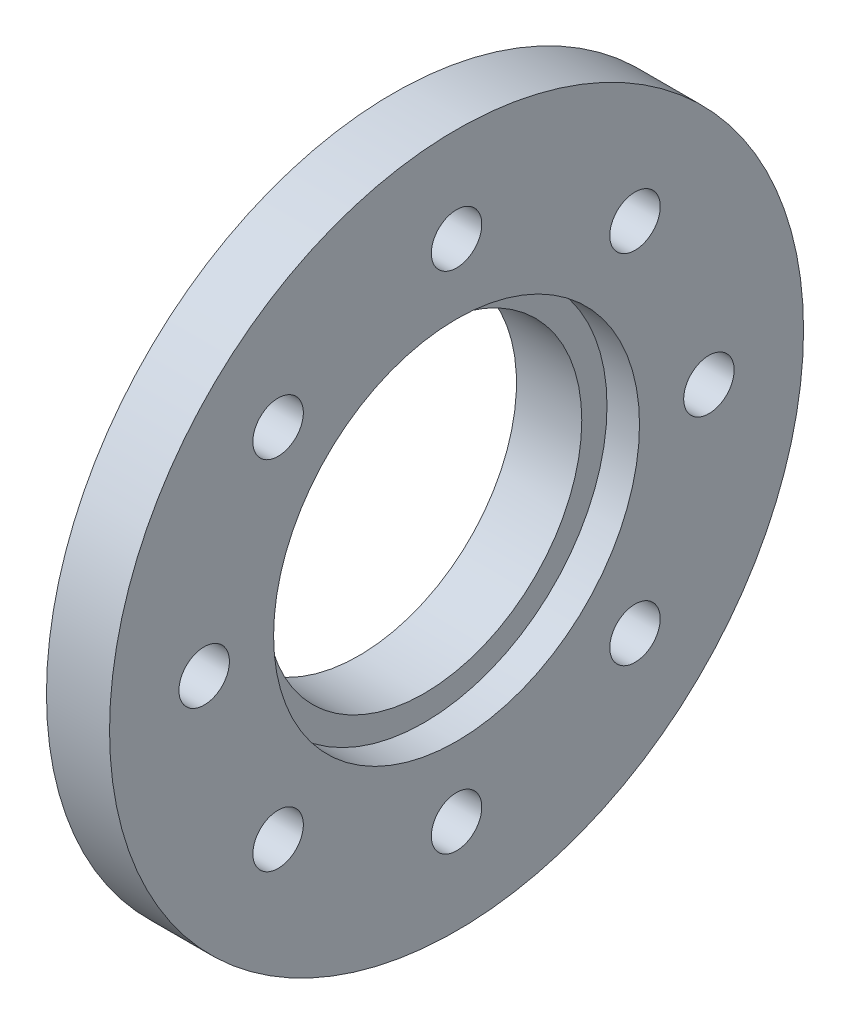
ISO-10303-21;
HEADER;
FILE_DESCRIPTION(('STEP AP214'),'2;1');
FILE_NAME('part.step','',(''),(''),'','','');
FILE_SCHEMA(('AUTOMOTIVE_DESIGN { 1 0 10303 214 1 1 1 1 }'));
ENDSEC;
DATA;
#1=APPLICATION_CONTEXT('core data for automotive mechanical design processes');
#2=APPLICATION_PROTOCOL_DEFINITION('international standard','automotive_design',2000,#1);
#3=PRODUCT_CONTEXT('',#1,'mechanical');
#4=PRODUCT('Part','Part','',(#3));
#5=PRODUCT_RELATED_PRODUCT_CATEGORY('part','',(#4));
#6=PRODUCT_DEFINITION_FORMATION('','',#4);
#7=PRODUCT_DEFINITION_CONTEXT('part definition',#1,'design');
#8=PRODUCT_DEFINITION('design','',#6,#7);
#9=PRODUCT_DEFINITION_SHAPE('','',#8);
#10=(LENGTH_UNIT() NAMED_UNIT(*) SI_UNIT(.MILLI.,.METRE.));
#11=(NAMED_UNIT(*) PLANE_ANGLE_UNIT() SI_UNIT($,.RADIAN.));
#12=(NAMED_UNIT(*) SI_UNIT($,.STERADIAN.) SOLID_ANGLE_UNIT());
#13=UNCERTAINTY_MEASURE_WITH_UNIT(LENGTH_MEASURE(1.E-05),#10,'distance_accuracy_value','');
#14=(GEOMETRIC_REPRESENTATION_CONTEXT(3) GLOBAL_UNCERTAINTY_ASSIGNED_CONTEXT((#13)) GLOBAL_UNIT_ASSIGNED_CONTEXT((#10,
#11,#12)) REPRESENTATION_CONTEXT('',''));
#15=CARTESIAN_POINT('',(0.,0.,0.));
#16=DIRECTION('',(0.,0.,1.));
#17=DIRECTION('',(1.,0.,0.));
#18=AXIS2_PLACEMENT_3D('',#15,#16,#17);
#19=CARTESIAN_POINT('',(0.,0.,0.));
#20=DIRECTION('',(-1.,0.,0.));
#21=DIRECTION('',(0.,0.,1.));
#22=AXIS2_PLACEMENT_3D('',#19,#20,#21);
#23=CYLINDRICAL_SURFACE('',#22,5.);
#24=CARTESIAN_POINT('',(0.,0.,0.));
#25=DIRECTION('',(-1.,0.,0.));
#26=DIRECTION('',(0.,0.,1.));
#27=AXIS2_PLACEMENT_3D('',#24,#25,#26);
#28=CIRCLE('',#27,5.);
#29=CARTESIAN_POINT('',(0.,0.,5.));
#30=VERTEX_POINT('',#29);
#31=EDGE_CURVE('E100',#30,#30,#28,.F.);
#32=ORIENTED_EDGE('',*,*,#31,.F.);
#33=EDGE_LOOP('',(#32));
#34=FACE_BOUND('',#33,.T.);
#35=CARTESIAN_POINT('',(2.07,0.,0.));
#36=DIRECTION('',(1.,0.,0.));
#37=DIRECTION('',(0.,0.,-1.));
#38=AXIS2_PLACEMENT_3D('',#35,#36,#37);
#39=CIRCLE('',#38,5.);
#40=CARTESIAN_POINT('',(2.07,0.,-5.));
#41=VERTEX_POINT('',#40);
#42=EDGE_CURVE('E108',#41,#41,#39,.T.);
#43=ORIENTED_EDGE('',*,*,#42,.T.);
#44=EDGE_LOOP('',(#43));
#45=FACE_BOUND('',#44,.T.);
#46=ADVANCED_FACE('F29',(#34,#45),#23,.F.);
#47=CARTESIAN_POINT('',(0.,5.,0.));
#48=DIRECTION('',(1.,0.,0.));
#49=DIRECTION('',(0.,0.,-1.));
#50=AXIS2_PLACEMENT_3D('',#47,#48,#49);
#51=PLANE('',#50);
#52=CARTESIAN_POINT('',(0.,0.,0.));
#53=DIRECTION('',(-1.,0.,0.));
#54=DIRECTION('',(0.,0.,1.));
#55=AXIS2_PLACEMENT_3D('',#52,#53,#54);
#56=CIRCLE('',#55,6.25);
#57=CARTESIAN_POINT('',(0.,0.,6.25000000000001));
#58=VERTEX_POINT('',#57);
#59=EDGE_CURVE('E33',#58,#58,#56,.F.);
#60=ORIENTED_EDGE('',*,*,#59,.F.);
#61=EDGE_LOOP('',(#60));
#62=FACE_BOUND('',#61,.T.);
#63=ORIENTED_EDGE('',*,*,#31,.T.);
#64=EDGE_LOOP('',(#63));
#65=FACE_BOUND('',#64,.T.);
#66=ADVANCED_FACE('F118',(#62,#65),#51,.F.);
#67=CARTESIAN_POINT('',(0.,0.,0.));
#68=DIRECTION('',(-1.,0.,0.));
#69=DIRECTION('',(0.,0.,1.));
#70=AXIS2_PLACEMENT_3D('',#67,#68,#69);
#71=CYLINDRICAL_SURFACE('',#70,6.25);
#72=ORIENTED_EDGE('',*,*,#59,.T.);
#73=EDGE_LOOP('',(#72));
#74=FACE_BOUND('',#73,.T.);
#75=CARTESIAN_POINT('',(1.1,0.,0.));
#76=DIRECTION('',(-1.,0.,0.));
#77=DIRECTION('',(0.,0.,1.));
#78=AXIS2_PLACEMENT_3D('',#75,#76,#77);
#79=CIRCLE('',#78,6.25);
#80=CARTESIAN_POINT('',(1.1,0.,6.25000000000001));
#81=VERTEX_POINT('',#80);
#82=EDGE_CURVE('E98',#81,#81,#79,.T.);
#83=ORIENTED_EDGE('',*,*,#82,.T.);
#84=EDGE_LOOP('',(#83));
#85=FACE_BOUND('',#84,.T.);
#86=ADVANCED_FACE('F126',(#74,#85),#71,.T.);
#87=CARTESIAN_POINT('',(1.1,6.25,0.));
#88=DIRECTION('',(1.,0.,0.));
#89=DIRECTION('',(0.,0.,-1.));
#90=AXIS2_PLACEMENT_3D('',#87,#88,#89);
#91=PLANE('',#90);
#92=CARTESIAN_POINT('',(1.1,5.65685424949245,-5.65685424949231));
#93=DIRECTION('',(-1.,0.,0.));
#94=DIRECTION('',(0.,0.,1.));
#95=AXIS2_PLACEMENT_3D('',#92,#93,#94);
#96=CIRCLE('',#95,0.799999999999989);
#97=CARTESIAN_POINT('',(1.1,5.65685424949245,-4.85685424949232));
#98=VERTEX_POINT('',#97);
#99=EDGE_CURVE('E95',#98,#98,#96,.F.);
#100=ORIENTED_EDGE('',*,*,#99,.T.);
#101=EDGE_LOOP('',(#100));
#102=FACE_BOUND('',#101,.T.);
#103=CARTESIAN_POINT('',(1.1,0.,-8.00000000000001));
#104=DIRECTION('',(-1.,0.,0.));
#105=DIRECTION('',(0.,0.,1.));
#106=AXIS2_PLACEMENT_3D('',#103,#104,#105);
#107=CIRCLE('',#106,0.799999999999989);
#108=CARTESIAN_POINT('',(1.1,0.,-7.20000000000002));
#109=VERTEX_POINT('',#108);
#110=EDGE_CURVE('E92',#109,#109,#107,.F.);
#111=ORIENTED_EDGE('',*,*,#110,.T.);
#112=EDGE_LOOP('',(#111));
#113=FACE_BOUND('',#112,.T.);
#114=CARTESIAN_POINT('',(1.1,0.,0.));
#115=DIRECTION('',(-1.,0.,0.));
#116=DIRECTION('',(0.,0.,1.));
#117=AXIS2_PLACEMENT_3D('',#114,#115,#116);
#118=CIRCLE('',#117,11.);
#119=CARTESIAN_POINT('',(1.1,0.,11.));
#120=VERTEX_POINT('',#119);
#121=EDGE_CURVE('E71',#120,#120,#118,.F.);
#122=ORIENTED_EDGE('',*,*,#121,.F.);
#123=EDGE_LOOP('',(#122));
#124=FACE_BOUND('',#123,.T.);
#125=ORIENTED_EDGE('',*,*,#82,.F.);
#126=EDGE_LOOP('',(#125));
#127=FACE_BOUND('',#126,.T.);
#128=CARTESIAN_POINT('',(1.1,8.,0.));
#129=DIRECTION('',(-1.,0.,0.));
#130=DIRECTION('',(0.,0.,1.));
#131=AXIS2_PLACEMENT_3D('',#128,#129,#130);
#132=CIRCLE('',#131,0.799999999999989);
#133=CARTESIAN_POINT('',(1.1,8.,0.799999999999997));
#134=VERTEX_POINT('',#133);
#135=EDGE_CURVE('E74',#134,#134,#132,.F.);
#136=ORIENTED_EDGE('',*,*,#135,.T.);
#137=EDGE_LOOP('',(#136));
#138=FACE_BOUND('',#137,.T.);
#139=CARTESIAN_POINT('',(1.1,5.65685424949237,5.6568542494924));
#140=DIRECTION('',(-1.,0.,0.));
#141=DIRECTION('',(0.,0.,1.));
#142=AXIS2_PLACEMENT_3D('',#139,#140,#141);
#143=CIRCLE('',#142,0.799999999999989);
#144=CARTESIAN_POINT('',(1.1,5.65685424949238,6.45685424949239));
#145=VERTEX_POINT('',#144);
#146=EDGE_CURVE('E77',#145,#145,#143,.F.);
#147=ORIENTED_EDGE('',*,*,#146,.T.);
#148=EDGE_LOOP('',(#147));
#149=FACE_BOUND('',#148,.T.);
#150=CARTESIAN_POINT('',(1.1,0.,8.00000000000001));
#151=DIRECTION('',(-1.,0.,0.));
#152=DIRECTION('',(0.,0.,1.));
#153=AXIS2_PLACEMENT_3D('',#150,#151,#152);
#154=CIRCLE('',#153,0.799999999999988);
#155=CARTESIAN_POINT('',(1.1,0.,8.8));
#156=VERTEX_POINT('',#155);
#157=EDGE_CURVE('E80',#156,#156,#154,.F.);
#158=ORIENTED_EDGE('',*,*,#157,.T.);
#159=EDGE_LOOP('',(#158));
#160=FACE_BOUND('',#159,.T.);
#161=CARTESIAN_POINT('',(1.1,-5.65685424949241,5.65685424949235));
#162=DIRECTION('',(-1.,0.,0.));
#163=DIRECTION('',(0.,0.,1.));
#164=AXIS2_PLACEMENT_3D('',#161,#162,#163);
#165=CIRCLE('',#164,0.799999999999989);
#166=CARTESIAN_POINT('',(1.1,-5.65685424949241,6.45685424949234));
#167=VERTEX_POINT('',#166);
#168=EDGE_CURVE('E83',#167,#167,#165,.F.);
#169=ORIENTED_EDGE('',*,*,#168,.T.);
#170=EDGE_LOOP('',(#169));
#171=FACE_BOUND('',#170,.T.);
#172=CARTESIAN_POINT('',(1.1,-8.,0.));
#173=DIRECTION('',(-1.,0.,0.));
#174=DIRECTION('',(0.,0.,1.));
#175=AXIS2_PLACEMENT_3D('',#172,#173,#174);
#176=CIRCLE('',#175,0.799999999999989);
#177=CARTESIAN_POINT('',(1.1,-8.,0.799999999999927));
#178=VERTEX_POINT('',#177);
#179=EDGE_CURVE('E86',#178,#178,#176,.F.);
#180=ORIENTED_EDGE('',*,*,#179,.T.);
#181=EDGE_LOOP('',(#180));
#182=FACE_BOUND('',#181,.T.);
#183=CARTESIAN_POINT('',(1.1,-5.65685424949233,-5.65685424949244));
#184=DIRECTION('',(-1.,0.,0.));
#185=DIRECTION('',(0.,0.,1.));
#186=AXIS2_PLACEMENT_3D('',#183,#184,#185);
#187=CIRCLE('',#186,0.799999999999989);
#188=CARTESIAN_POINT('',(1.1,-5.65685424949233,-4.85685424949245));
#189=VERTEX_POINT('',#188);
#190=EDGE_CURVE('E89',#189,#189,#187,.F.);
#191=ORIENTED_EDGE('',*,*,#190,.T.);
#192=EDGE_LOOP('',(#191));
#193=FACE_BOUND('',#192,.T.);
#194=ADVANCED_FACE('F135',(#102,#113,#124,#127,#138,#149,#160,#171,#182,#193),#91,.F.);
#195=CARTESIAN_POINT('',(1.1,5.65685424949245,-5.65685424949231));
#196=DIRECTION('',(-1.,0.,0.));
#197=DIRECTION('',(0.,0.,1.));
#198=AXIS2_PLACEMENT_3D('',#195,#196,#197);
#199=CYLINDRICAL_SURFACE('',#198,0.799999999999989);
#200=CARTESIAN_POINT('',(3.1,5.65685424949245,-5.65685424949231));
#201=DIRECTION('',(-1.,0.,0.));
#202=DIRECTION('',(0.,0.,1.));
#203=AXIS2_PLACEMENT_3D('',#200,#201,#202);
#204=CIRCLE('',#203,0.799999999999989);
#205=CARTESIAN_POINT('',(3.1,5.65685424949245,-4.85685424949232));
#206=VERTEX_POINT('',#205);
#207=EDGE_CURVE('E68',#206,#206,#204,.F.);
#208=ORIENTED_EDGE('',*,*,#207,.T.);
#209=EDGE_LOOP('',(#208));
#210=FACE_BOUND('',#209,.T.);
#211=ORIENTED_EDGE('',*,*,#99,.F.);
#212=EDGE_LOOP('',(#211));
#213=FACE_BOUND('',#212,.T.);
#214=ADVANCED_FACE('F138',(#210,#213),#199,.F.);
#215=CARTESIAN_POINT('',(1.1,0.,-8.00000000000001));
#216=DIRECTION('',(-1.,0.,0.));
#217=DIRECTION('',(0.,0.,1.));
#218=AXIS2_PLACEMENT_3D('',#215,#216,#217);
#219=CYLINDRICAL_SURFACE('',#218,0.799999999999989);
#220=CARTESIAN_POINT('',(3.1,0.,-8.00000000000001));
#221=DIRECTION('',(-1.,0.,0.));
#222=DIRECTION('',(0.,0.,1.));
#223=AXIS2_PLACEMENT_3D('',#220,#221,#222);
#224=CIRCLE('',#223,0.799999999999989);
#225=CARTESIAN_POINT('',(3.1,0.,-7.20000000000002));
#226=VERTEX_POINT('',#225);
#227=EDGE_CURVE('E65',#226,#226,#224,.F.);
#228=ORIENTED_EDGE('',*,*,#227,.T.);
#229=EDGE_LOOP('',(#228));
#230=FACE_BOUND('',#229,.T.);
#231=ORIENTED_EDGE('',*,*,#110,.F.);
#232=EDGE_LOOP('',(#231));
#233=FACE_BOUND('',#232,.T.);
#234=ADVANCED_FACE('F142',(#230,#233),#219,.F.);
#235=CARTESIAN_POINT('',(1.1,-5.65685424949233,-5.65685424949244));
#236=DIRECTION('',(-1.,0.,0.));
#237=DIRECTION('',(0.,0.,1.));
#238=AXIS2_PLACEMENT_3D('',#235,#236,#237);
#239=CYLINDRICAL_SURFACE('',#238,0.799999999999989);
#240=CARTESIAN_POINT('',(3.1,-5.65685424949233,-5.65685424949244));
#241=DIRECTION('',(-1.,0.,0.));
#242=DIRECTION('',(0.,0.,1.));
#243=AXIS2_PLACEMENT_3D('',#240,#241,#242);
#244=CIRCLE('',#243,0.799999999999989);
#245=CARTESIAN_POINT('',(3.1,-5.65685424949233,-4.85685424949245));
#246=VERTEX_POINT('',#245);
#247=EDGE_CURVE('E62',#246,#246,#244,.F.);
#248=ORIENTED_EDGE('',*,*,#247,.T.);
#249=EDGE_LOOP('',(#248));
#250=FACE_BOUND('',#249,.T.);
#251=ORIENTED_EDGE('',*,*,#190,.F.);
#252=EDGE_LOOP('',(#251));
#253=FACE_BOUND('',#252,.T.);
#254=ADVANCED_FACE('F146',(#250,#253),#239,.F.);
#255=CARTESIAN_POINT('',(1.1,-8.,0.));
#256=DIRECTION('',(-1.,0.,0.));
#257=DIRECTION('',(0.,0.,1.));
#258=AXIS2_PLACEMENT_3D('',#255,#256,#257);
#259=CYLINDRICAL_SURFACE('',#258,0.799999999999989);
#260=CARTESIAN_POINT('',(3.1,-8.,0.));
#261=DIRECTION('',(-1.,0.,0.));
#262=DIRECTION('',(0.,0.,1.));
#263=AXIS2_PLACEMENT_3D('',#260,#261,#262);
#264=CIRCLE('',#263,0.799999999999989);
#265=CARTESIAN_POINT('',(3.1,-8.,0.799999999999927));
#266=VERTEX_POINT('',#265);
#267=EDGE_CURVE('E59',#266,#266,#264,.F.);
#268=ORIENTED_EDGE('',*,*,#267,.T.);
#269=EDGE_LOOP('',(#268));
#270=FACE_BOUND('',#269,.T.);
#271=ORIENTED_EDGE('',*,*,#179,.F.);
#272=EDGE_LOOP('',(#271));
#273=FACE_BOUND('',#272,.T.);
#274=ADVANCED_FACE('F150',(#270,#273),#259,.F.);
#275=CARTESIAN_POINT('',(1.1,-5.65685424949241,5.65685424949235));
#276=DIRECTION('',(-1.,0.,0.));
#277=DIRECTION('',(0.,0.,1.));
#278=AXIS2_PLACEMENT_3D('',#275,#276,#277);
#279=CYLINDRICAL_SURFACE('',#278,0.799999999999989);
#280=CARTESIAN_POINT('',(3.1,-5.65685424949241,5.65685424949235));
#281=DIRECTION('',(-1.,0.,0.));
#282=DIRECTION('',(0.,0.,1.));
#283=AXIS2_PLACEMENT_3D('',#280,#281,#282);
#284=CIRCLE('',#283,0.799999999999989);
#285=CARTESIAN_POINT('',(3.1,-5.65685424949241,6.45685424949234));
#286=VERTEX_POINT('',#285);
#287=EDGE_CURVE('E56',#286,#286,#284,.F.);
#288=ORIENTED_EDGE('',*,*,#287,.T.);
#289=EDGE_LOOP('',(#288));
#290=FACE_BOUND('',#289,.T.);
#291=ORIENTED_EDGE('',*,*,#168,.F.);
#292=EDGE_LOOP('',(#291));
#293=FACE_BOUND('',#292,.T.);
#294=ADVANCED_FACE('F154',(#290,#293),#279,.F.);
#295=CARTESIAN_POINT('',(1.1,0.,8.00000000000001));
#296=DIRECTION('',(-1.,0.,0.));
#297=DIRECTION('',(0.,0.,1.));
#298=AXIS2_PLACEMENT_3D('',#295,#296,#297);
#299=CYLINDRICAL_SURFACE('',#298,0.799999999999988);
#300=CARTESIAN_POINT('',(3.1,0.,8.00000000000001));
#301=DIRECTION('',(-1.,0.,0.));
#302=DIRECTION('',(0.,0.,1.));
#303=AXIS2_PLACEMENT_3D('',#300,#301,#302);
#304=CIRCLE('',#303,0.799999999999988);
#305=CARTESIAN_POINT('',(3.1,0.,8.8));
#306=VERTEX_POINT('',#305);
#307=EDGE_CURVE('E53',#306,#306,#304,.F.);
#308=ORIENTED_EDGE('',*,*,#307,.T.);
#309=EDGE_LOOP('',(#308));
#310=FACE_BOUND('',#309,.T.);
#311=ORIENTED_EDGE('',*,*,#157,.F.);
#312=EDGE_LOOP('',(#311));
#313=FACE_BOUND('',#312,.T.);
#314=ADVANCED_FACE('F158',(#310,#313),#299,.F.);
#315=CARTESIAN_POINT('',(1.1,5.65685424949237,5.6568542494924));
#316=DIRECTION('',(-1.,0.,0.));
#317=DIRECTION('',(0.,0.,1.));
#318=AXIS2_PLACEMENT_3D('',#315,#316,#317);
#319=CYLINDRICAL_SURFACE('',#318,0.799999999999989);
#320=CARTESIAN_POINT('',(3.1,5.65685424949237,5.6568542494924));
#321=DIRECTION('',(-1.,0.,0.));
#322=DIRECTION('',(0.,0.,1.));
#323=AXIS2_PLACEMENT_3D('',#320,#321,#322);
#324=CIRCLE('',#323,0.799999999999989);
#325=CARTESIAN_POINT('',(3.1,5.65685424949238,6.45685424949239));
#326=VERTEX_POINT('',#325);
#327=EDGE_CURVE('E50',#326,#326,#324,.F.);
#328=ORIENTED_EDGE('',*,*,#327,.T.);
#329=EDGE_LOOP('',(#328));
#330=FACE_BOUND('',#329,.T.);
#331=ORIENTED_EDGE('',*,*,#146,.F.);
#332=EDGE_LOOP('',(#331));
#333=FACE_BOUND('',#332,.T.);
#334=ADVANCED_FACE('F162',(#330,#333),#319,.F.);
#335=CARTESIAN_POINT('',(1.1,8.,0.));
#336=DIRECTION('',(-1.,0.,0.));
#337=DIRECTION('',(0.,0.,1.));
#338=AXIS2_PLACEMENT_3D('',#335,#336,#337);
#339=CYLINDRICAL_SURFACE('',#338,0.799999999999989);
#340=CARTESIAN_POINT('',(3.1,8.,0.));
#341=DIRECTION('',(-1.,0.,0.));
#342=DIRECTION('',(0.,0.,1.));
#343=AXIS2_PLACEMENT_3D('',#340,#341,#342);
#344=CIRCLE('',#343,0.799999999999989);
#345=CARTESIAN_POINT('',(3.1,8.,0.799999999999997));
#346=VERTEX_POINT('',#345);
#347=EDGE_CURVE('E42',#346,#346,#344,.F.);
#348=ORIENTED_EDGE('',*,*,#347,.T.);
#349=EDGE_LOOP('',(#348));
#350=FACE_BOUND('',#349,.T.);
#351=ORIENTED_EDGE('',*,*,#135,.F.);
#352=EDGE_LOOP('',(#351));
#353=FACE_BOUND('',#352,.T.);
#354=ADVANCED_FACE('F166',(#350,#353),#339,.F.);
#355=CARTESIAN_POINT('',(0.,0.,0.));
#356=DIRECTION('',(-1.,0.,0.));
#357=DIRECTION('',(0.,0.,1.));
#358=AXIS2_PLACEMENT_3D('',#355,#356,#357);
#359=CYLINDRICAL_SURFACE('',#358,11.);
#360=ORIENTED_EDGE('',*,*,#121,.T.);
#361=EDGE_LOOP('',(#360));
#362=FACE_BOUND('',#361,.T.);
#363=CARTESIAN_POINT('',(3.1,0.,0.));
#364=DIRECTION('',(-1.,0.,0.));
#365=DIRECTION('',(0.,0.,1.));
#366=AXIS2_PLACEMENT_3D('',#363,#364,#365);
#367=CIRCLE('',#366,11.);
#368=CARTESIAN_POINT('',(3.1,0.,11.));
#369=VERTEX_POINT('',#368);
#370=EDGE_CURVE('E37',#369,#369,#367,.T.);
#371=ORIENTED_EDGE('',*,*,#370,.T.);
#372=EDGE_LOOP('',(#371));
#373=FACE_BOUND('',#372,.T.);
#374=ADVANCED_FACE('F170',(#362,#373),#359,.T.);
#375=CARTESIAN_POINT('',(0.,0.,0.));
#376=DIRECTION('',(-1.,0.,0.));
#377=DIRECTION('',(0.,0.,1.));
#378=AXIS2_PLACEMENT_3D('',#375,#376,#377);
#379=CYLINDRICAL_SURFACE('',#378,5.8);
#380=CARTESIAN_POINT('',(3.1,0.,0.));
#381=DIRECTION('',(-1.,0.,0.));
#382=DIRECTION('',(0.,0.,1.));
#383=AXIS2_PLACEMENT_3D('',#380,#381,#382);
#384=CIRCLE('',#383,5.8);
#385=CARTESIAN_POINT('',(3.1,0.,5.80000000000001));
#386=VERTEX_POINT('',#385);
#387=EDGE_CURVE('E10',#386,#386,#384,.F.);
#388=ORIENTED_EDGE('',*,*,#387,.T.);
#389=EDGE_LOOP('',(#388));
#390=FACE_BOUND('',#389,.T.);
#391=CARTESIAN_POINT('',(2.07,0.,0.));
#392=DIRECTION('',(1.,0.,0.));
#393=DIRECTION('',(0.,0.,-1.));
#394=AXIS2_PLACEMENT_3D('',#391,#392,#393);
#395=CIRCLE('',#394,5.80000000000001);
#396=CARTESIAN_POINT('',(2.07,0.,-5.80000000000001));
#397=VERTEX_POINT('',#396);
#398=EDGE_CURVE('E45',#397,#397,#395,.T.);
#399=ORIENTED_EDGE('',*,*,#398,.F.);
#400=EDGE_LOOP('',(#399));
#401=FACE_BOUND('',#400,.T.);
#402=ADVANCED_FACE('F122',(#390,#401),#379,.F.);
#403=CARTESIAN_POINT('',(3.1,11.,0.));
#404=DIRECTION('',(-1.,0.,0.));
#405=DIRECTION('',(0.,0.,1.));
#406=AXIS2_PLACEMENT_3D('',#403,#404,#405);
#407=PLANE('',#406);
#408=ORIENTED_EDGE('',*,*,#387,.F.);
#409=EDGE_LOOP('',(#408));
#410=FACE_BOUND('',#409,.T.);
#411=ORIENTED_EDGE('',*,*,#370,.F.);
#412=EDGE_LOOP('',(#411));
#413=FACE_BOUND('',#412,.T.);
#414=ORIENTED_EDGE('',*,*,#347,.F.);
#415=EDGE_LOOP('',(#414));
#416=FACE_BOUND('',#415,.T.);
#417=ORIENTED_EDGE('',*,*,#327,.F.);
#418=EDGE_LOOP('',(#417));
#419=FACE_BOUND('',#418,.T.);
#420=ORIENTED_EDGE('',*,*,#307,.F.);
#421=EDGE_LOOP('',(#420));
#422=FACE_BOUND('',#421,.T.);
#423=ORIENTED_EDGE('',*,*,#287,.F.);
#424=EDGE_LOOP('',(#423));
#425=FACE_BOUND('',#424,.T.);
#426=ORIENTED_EDGE('',*,*,#267,.F.);
#427=EDGE_LOOP('',(#426));
#428=FACE_BOUND('',#427,.T.);
#429=ORIENTED_EDGE('',*,*,#247,.F.);
#430=EDGE_LOOP('',(#429));
#431=FACE_BOUND('',#430,.T.);
#432=ORIENTED_EDGE('',*,*,#227,.F.);
#433=EDGE_LOOP('',(#432));
#434=FACE_BOUND('',#433,.T.);
#435=ORIENTED_EDGE('',*,*,#207,.F.);
#436=EDGE_LOOP('',(#435));
#437=FACE_BOUND('',#436,.T.);
#438=ADVANCED_FACE('F31',(#410,#413,#416,#419,#422,#425,#428,#431,#434,#437),#407,.F.);
#439=CARTESIAN_POINT('',(2.07,0.,0.));
#440=DIRECTION('',(1.,0.,0.));
#441=DIRECTION('',(0.,0.,-1.));
#442=AXIS2_PLACEMENT_3D('',#439,#440,#441);
#443=PLANE('',#442);
#444=ORIENTED_EDGE('',*,*,#42,.F.);
#445=EDGE_LOOP('',(#444));
#446=FACE_BOUND('',#445,.T.);
#447=ORIENTED_EDGE('',*,*,#398,.T.);
#448=EDGE_LOOP('',(#447));
#449=FACE_BOUND('',#448,.T.);
#450=ADVANCED_FACE('F115',(#446,#449),#443,.T.);
#451=CLOSED_SHELL('',(#46,#66,#86,#194,#214,#234,#254,#274,#294,#314,#334,#354,#374,#402,#438,#450));
#452=MANIFOLD_SOLID_BREP('B2',#451);
#453=ADVANCED_BREP_SHAPE_REPRESENTATION('',(#18,#452),#14);
#454=SHAPE_DEFINITION_REPRESENTATION(#9,#453);
ENDSEC;
END-ISO-10303-21;
